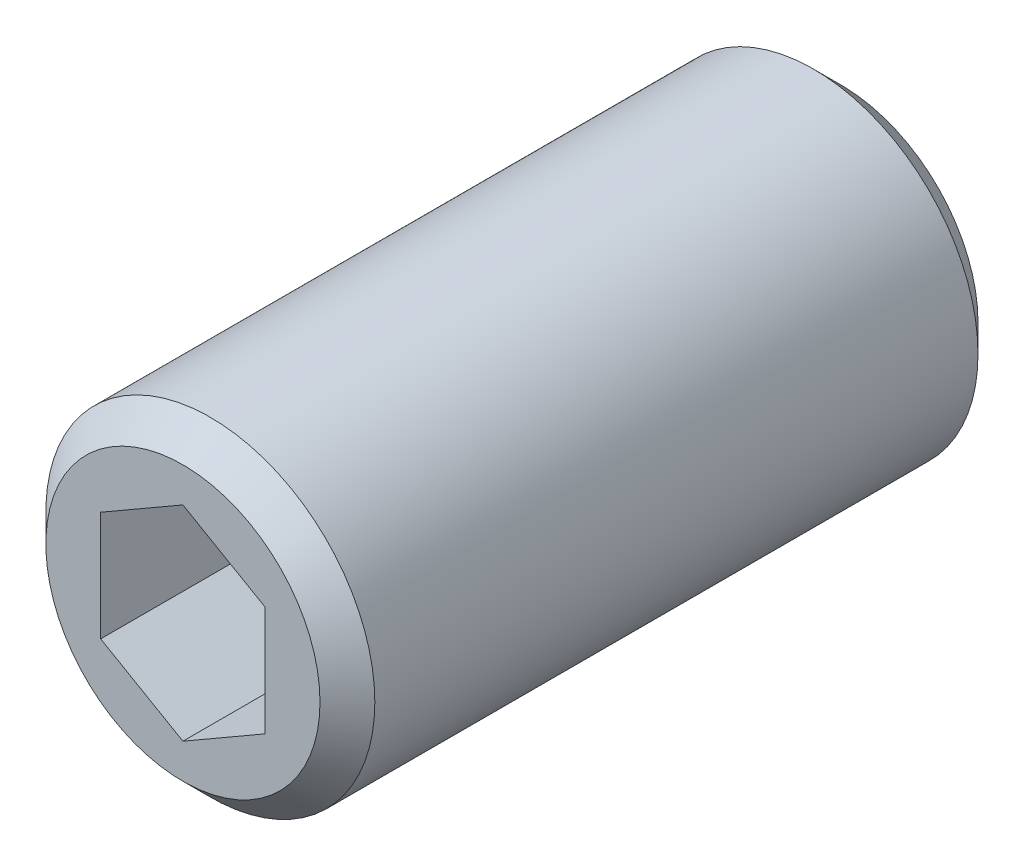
ISO-10303-21;
HEADER;
FILE_DESCRIPTION(('STEP AP214'),'2;1');
FILE_NAME('part.step','',(''),(''),'','','');
FILE_SCHEMA(('AUTOMOTIVE_DESIGN { 1 0 10303 214 1 1 1 1 }'));
ENDSEC;
DATA;
#1=APPLICATION_CONTEXT('core data for automotive mechanical design processes');
#2=APPLICATION_PROTOCOL_DEFINITION('international standard','automotive_design',2000,#1);
#3=PRODUCT_CONTEXT('',#1,'mechanical');
#4=PRODUCT('Part','Part','',(#3));
#5=PRODUCT_RELATED_PRODUCT_CATEGORY('part','',(#4));
#6=PRODUCT_DEFINITION_FORMATION('','',#4);
#7=PRODUCT_DEFINITION_CONTEXT('part definition',#1,'design');
#8=PRODUCT_DEFINITION('design','',#6,#7);
#9=PRODUCT_DEFINITION_SHAPE('','',#8);
#10=(LENGTH_UNIT() NAMED_UNIT(*) SI_UNIT(.MILLI.,.METRE.));
#11=(NAMED_UNIT(*) PLANE_ANGLE_UNIT() SI_UNIT($,.RADIAN.));
#12=(NAMED_UNIT(*) SI_UNIT($,.STERADIAN.) SOLID_ANGLE_UNIT());
#13=UNCERTAINTY_MEASURE_WITH_UNIT(LENGTH_MEASURE(1.E-05),#10,'distance_accuracy_value','');
#14=(GEOMETRIC_REPRESENTATION_CONTEXT(3) GLOBAL_UNCERTAINTY_ASSIGNED_CONTEXT((#13)) GLOBAL_UNIT_ASSIGNED_CONTEXT((#10,
#11,#12)) REPRESENTATION_CONTEXT('',''));
#15=CARTESIAN_POINT('',(0.,0.,0.));
#16=DIRECTION('',(0.,0.,1.));
#17=DIRECTION('',(1.,0.,0.));
#18=AXIS2_PLACEMENT_3D('',#15,#16,#17);
#19=CARTESIAN_POINT('',(0.,1.86602540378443,8.));
#20=DIRECTION('',(-0.499999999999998,0.86602540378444,0.));
#21=DIRECTION('',(-0.86602540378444,-0.499999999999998,0.));
#22=AXIS2_PLACEMENT_3D('',#19,#20,#21);
#23=PLANE('',#22);
#24=DIRECTION('',(0.,0.,1.));
#25=VECTOR('',#24,1.);
#26=CARTESIAN_POINT('',(0.,1.86602540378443,8.));
#27=LINE('',#26,#25);
#28=CARTESIAN_POINT('',(0.,1.86602540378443,8.));
#29=VERTEX_POINT('',#28);
#30=CARTESIAN_POINT('',(0.,1.86602540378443,12.));
#31=VERTEX_POINT('',#30);
#32=EDGE_CURVE('E49',#29,#31,#27,.T.);
#33=ORIENTED_EDGE('',*,*,#32,.T.);
#34=DIRECTION('',(-0.86602540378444,-0.499999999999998,0.));
#35=VECTOR('',#34,1.);
#36=CARTESIAN_POINT('',(0.,1.86602540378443,12.));
#37=LINE('',#36,#35);
#38=CARTESIAN_POINT('',(-1.5,1.,12.));
#39=VERTEX_POINT('',#38);
#40=EDGE_CURVE('E42',#31,#39,#37,.T.);
#41=ORIENTED_EDGE('',*,*,#40,.T.);
#42=DIRECTION('',(0.,0.,1.));
#43=VECTOR('',#42,1.);
#44=CARTESIAN_POINT('',(-1.5,1.,8.));
#45=LINE('',#44,#43);
#46=CARTESIAN_POINT('',(-1.5,1.,8.));
#47=VERTEX_POINT('',#46);
#48=EDGE_CURVE('E93',#47,#39,#45,.T.);
#49=ORIENTED_EDGE('',*,*,#48,.F.);
#50=DIRECTION('',(-0.86602540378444,-0.499999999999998,0.));
#51=VECTOR('',#50,1.);
#52=CARTESIAN_POINT('',(0.,1.86602540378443,8.));
#53=LINE('',#52,#51);
#54=EDGE_CURVE('E114',#29,#47,#53,.T.);
#55=ORIENTED_EDGE('',*,*,#54,.F.);
#56=EDGE_LOOP('',(#33,#41,#49,#55));
#57=FACE_BOUND('',#56,.T.);
#58=ADVANCED_FACE('F27',(#57),#23,.F.);
#59=CARTESIAN_POINT('',(1.5,1.,8.));
#60=DIRECTION('',(0.499999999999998,0.86602540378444,0.));
#61=DIRECTION('',(-0.86602540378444,0.499999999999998,0.));
#62=AXIS2_PLACEMENT_3D('',#59,#60,#61);
#63=PLANE('',#62);
#64=DIRECTION('',(0.,0.,1.));
#65=VECTOR('',#64,1.);
#66=CARTESIAN_POINT('',(1.5,1.,8.));
#67=LINE('',#66,#65);
#68=CARTESIAN_POINT('',(1.5,1.,8.));
#69=VERTEX_POINT('',#68);
#70=CARTESIAN_POINT('',(1.5,1.,12.));
#71=VERTEX_POINT('',#70);
#72=EDGE_CURVE('E133',#69,#71,#67,.T.);
#73=ORIENTED_EDGE('',*,*,#72,.T.);
#74=DIRECTION('',(-0.86602540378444,0.499999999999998,0.));
#75=VECTOR('',#74,1.);
#76=CARTESIAN_POINT('',(1.5,1.,12.));
#77=LINE('',#76,#75);
#78=EDGE_CURVE('E112',#71,#31,#77,.T.);
#79=ORIENTED_EDGE('',*,*,#78,.T.);
#80=ORIENTED_EDGE('',*,*,#32,.F.);
#81=DIRECTION('',(-0.86602540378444,0.499999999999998,0.));
#82=VECTOR('',#81,1.);
#83=CARTESIAN_POINT('',(1.5,1.,8.));
#84=LINE('',#83,#82);
#85=EDGE_CURVE('E126',#69,#29,#84,.T.);
#86=ORIENTED_EDGE('',*,*,#85,.F.);
#87=EDGE_LOOP('',(#73,#79,#80,#86));
#88=FACE_BOUND('',#87,.T.);
#89=ADVANCED_FACE('F170',(#88),#63,.F.);
#90=CARTESIAN_POINT('',(1.5,-1.,8.));
#91=DIRECTION('',(1.,0.,0.));
#92=DIRECTION('',(0.,0.,-1.));
#93=AXIS2_PLACEMENT_3D('',#90,#91,#92);
#94=PLANE('',#93);
#95=DIRECTION('',(0.,0.,1.));
#96=VECTOR('',#95,1.);
#97=CARTESIAN_POINT('',(1.5,-1.,8.));
#98=LINE('',#97,#96);
#99=CARTESIAN_POINT('',(1.5,-1.,8.));
#100=VERTEX_POINT('',#99);
#101=CARTESIAN_POINT('',(1.5,-1.,12.));
#102=VERTEX_POINT('',#101);
#103=EDGE_CURVE('E131',#100,#102,#98,.T.);
#104=ORIENTED_EDGE('',*,*,#103,.T.);
#105=DIRECTION('',(0.,1.,0.));
#106=VECTOR('',#105,1.);
#107=CARTESIAN_POINT('',(1.5,-1.,12.));
#108=LINE('',#107,#106);
#109=EDGE_CURVE('E106',#102,#71,#108,.T.);
#110=ORIENTED_EDGE('',*,*,#109,.T.);
#111=ORIENTED_EDGE('',*,*,#72,.F.);
#112=DIRECTION('',(0.,1.,0.));
#113=VECTOR('',#112,1.);
#114=CARTESIAN_POINT('',(1.5,-1.,8.));
#115=LINE('',#114,#113);
#116=EDGE_CURVE('E123',#100,#69,#115,.T.);
#117=ORIENTED_EDGE('',*,*,#116,.F.);
#118=EDGE_LOOP('',(#104,#110,#111,#117));
#119=FACE_BOUND('',#118,.T.);
#120=ADVANCED_FACE('F175',(#119),#94,.F.);
#121=CARTESIAN_POINT('',(0.,-1.86602540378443,8.));
#122=DIRECTION('',(0.499999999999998,-0.86602540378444,0.));
#123=DIRECTION('',(0.86602540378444,0.499999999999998,0.));
#124=AXIS2_PLACEMENT_3D('',#121,#122,#123);
#125=PLANE('',#124);
#126=DIRECTION('',(0.,0.,1.));
#127=VECTOR('',#126,1.);
#128=CARTESIAN_POINT('',(0.,-1.86602540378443,8.));
#129=LINE('',#128,#127);
#130=CARTESIAN_POINT('',(0.,-1.86602540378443,8.));
#131=VERTEX_POINT('',#130);
#132=CARTESIAN_POINT('',(0.,-1.86602540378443,12.));
#133=VERTEX_POINT('',#132);
#134=EDGE_CURVE('E92',#131,#133,#129,.T.);
#135=ORIENTED_EDGE('',*,*,#134,.T.);
#136=DIRECTION('',(0.86602540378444,0.499999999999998,0.));
#137=VECTOR('',#136,1.);
#138=CARTESIAN_POINT('',(0.,-1.86602540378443,12.));
#139=LINE('',#138,#137);
#140=EDGE_CURVE('E104',#133,#102,#139,.T.);
#141=ORIENTED_EDGE('',*,*,#140,.T.);
#142=ORIENTED_EDGE('',*,*,#103,.F.);
#143=DIRECTION('',(0.86602540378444,0.499999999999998,0.));
#144=VECTOR('',#143,1.);
#145=CARTESIAN_POINT('',(0.,-1.86602540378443,8.));
#146=LINE('',#145,#144);
#147=EDGE_CURVE('E120',#131,#100,#146,.T.);
#148=ORIENTED_EDGE('',*,*,#147,.F.);
#149=EDGE_LOOP('',(#135,#141,#142,#148));
#150=FACE_BOUND('',#149,.T.);
#151=ADVANCED_FACE('F181',(#150),#125,.F.);
#152=CARTESIAN_POINT('',(-1.5,-1.,8.));
#153=DIRECTION('',(-0.499999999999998,-0.86602540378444,0.));
#154=DIRECTION('',(0.86602540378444,-0.499999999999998,0.));
#155=AXIS2_PLACEMENT_3D('',#152,#153,#154);
#156=PLANE('',#155);
#157=DIRECTION('',(0.,0.,1.));
#158=VECTOR('',#157,1.);
#159=CARTESIAN_POINT('',(-1.5,-1.,8.));
#160=LINE('',#159,#158);
#161=CARTESIAN_POINT('',(-1.5,-1.,8.));
#162=VERTEX_POINT('',#161);
#163=CARTESIAN_POINT('',(-1.5,-1.,12.));
#164=VERTEX_POINT('',#163);
#165=EDGE_CURVE('E81',#162,#164,#160,.T.);
#166=ORIENTED_EDGE('',*,*,#165,.T.);
#167=DIRECTION('',(0.86602540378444,-0.499999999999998,0.));
#168=VECTOR('',#167,1.);
#169=CARTESIAN_POINT('',(-1.5,-1.,12.));
#170=LINE('',#169,#168);
#171=EDGE_CURVE('E85',#164,#133,#170,.T.);
#172=ORIENTED_EDGE('',*,*,#171,.T.);
#173=ORIENTED_EDGE('',*,*,#134,.F.);
#174=DIRECTION('',(0.86602540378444,-0.499999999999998,0.));
#175=VECTOR('',#174,1.);
#176=CARTESIAN_POINT('',(-1.5,-1.,8.));
#177=LINE('',#176,#175);
#178=EDGE_CURVE('E88',#162,#131,#177,.T.);
#179=ORIENTED_EDGE('',*,*,#178,.F.);
#180=EDGE_LOOP('',(#166,#172,#173,#179));
#181=FACE_BOUND('',#180,.T.);
#182=ADVANCED_FACE('F83',(#181),#156,.F.);
#183=CARTESIAN_POINT('',(-1.5,1.,8.));
#184=DIRECTION('',(-1.,0.,0.));
#185=DIRECTION('',(0.,-1.,0.));
#186=AXIS2_PLACEMENT_3D('',#183,#184,#185);
#187=PLANE('',#186);
#188=DIRECTION('',(0.,-1.,0.));
#189=VECTOR('',#188,1.);
#190=CARTESIAN_POINT('',(-1.5,1.,8.));
#191=LINE('',#190,#189);
#192=EDGE_CURVE('E117',#47,#162,#191,.T.);
#193=ORIENTED_EDGE('',*,*,#192,.F.);
#194=ORIENTED_EDGE('',*,*,#48,.T.);
#195=DIRECTION('',(0.,-1.,0.));
#196=VECTOR('',#195,1.);
#197=CARTESIAN_POINT('',(-1.5,1.,12.));
#198=LINE('',#197,#196);
#199=EDGE_CURVE('E96',#39,#164,#198,.T.);
#200=ORIENTED_EDGE('',*,*,#199,.T.);
#201=ORIENTED_EDGE('',*,*,#165,.F.);
#202=EDGE_LOOP('',(#193,#194,#200,#201));
#203=FACE_BOUND('',#202,.T.);
#204=ADVANCED_FACE('F97',(#203),#187,.F.);
#205=CARTESIAN_POINT('',(1.5,2.73205080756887,8.));
#206=DIRECTION('',(0.,0.,-1.));
#207=DIRECTION('',(-1.,0.,0.));
#208=AXIS2_PLACEMENT_3D('',#205,#206,#207);
#209=PLANE('',#208);
#210=ORIENTED_EDGE('',*,*,#54,.T.);
#211=ORIENTED_EDGE('',*,*,#192,.T.);
#212=ORIENTED_EDGE('',*,*,#178,.T.);
#213=ORIENTED_EDGE('',*,*,#147,.T.);
#214=ORIENTED_EDGE('',*,*,#116,.T.);
#215=ORIENTED_EDGE('',*,*,#85,.T.);
#216=EDGE_LOOP('',(#210,#211,#212,#213,#214,#215));
#217=FACE_BOUND('',#216,.T.);
#218=ADVANCED_FACE('F155',(#217),#209,.F.);
#219=CARTESIAN_POINT('',(0.,0.,12.));
#220=DIRECTION('',(0.,0.,-1.));
#221=DIRECTION('',(-1.,0.,0.));
#222=AXIS2_PLACEMENT_3D('',#219,#220,#221);
#223=CYLINDRICAL_SURFACE('',#222,3.);
#224=CARTESIAN_POINT('',(0.,0.,0.500000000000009));
#225=DIRECTION('',(0.,0.,1.));
#226=DIRECTION('',(1.,0.,0.));
#227=AXIS2_PLACEMENT_3D('',#224,#225,#226);
#228=CIRCLE('',#227,3.);
#229=CARTESIAN_POINT('',(3.,0.,0.500000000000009));
#230=VERTEX_POINT('',#229);
#231=EDGE_CURVE('E139',#230,#230,#228,.T.);
#232=ORIENTED_EDGE('',*,*,#231,.T.);
#233=EDGE_LOOP('',(#232));
#234=FACE_BOUND('',#233,.T.);
#235=CARTESIAN_POINT('',(0.,0.,11.5));
#236=DIRECTION('',(0.,0.,1.));
#237=DIRECTION('',(1.,0.,0.));
#238=AXIS2_PLACEMENT_3D('',#235,#236,#237);
#239=CIRCLE('',#238,3.);
#240=CARTESIAN_POINT('',(3.,0.,11.5));
#241=VERTEX_POINT('',#240);
#242=EDGE_CURVE('E136',#241,#241,#239,.F.);
#243=ORIENTED_EDGE('',*,*,#242,.T.);
#244=EDGE_LOOP('',(#243));
#245=FACE_BOUND('',#244,.T.);
#246=ADVANCED_FACE('F29',(#234,#245),#223,.T.);
#247=CARTESIAN_POINT('',(0.,0.,12.));
#248=DIRECTION('',(0.,0.,1.));
#249=DIRECTION('',(1.,0.,0.));
#250=AXIS2_PLACEMENT_3D('',#247,#248,#249);
#251=PLANE('',#250);
#252=ORIENTED_EDGE('',*,*,#40,.F.);
#253=ORIENTED_EDGE('',*,*,#78,.F.);
#254=ORIENTED_EDGE('',*,*,#109,.F.);
#255=ORIENTED_EDGE('',*,*,#140,.F.);
#256=ORIENTED_EDGE('',*,*,#171,.F.);
#257=ORIENTED_EDGE('',*,*,#199,.F.);
#258=EDGE_LOOP('',(#252,#253,#254,#255,#256,#257));
#259=FACE_BOUND('',#258,.T.);
#260=CARTESIAN_POINT('',(0.,0.,12.));
#261=DIRECTION('',(0.,0.,1.));
#262=DIRECTION('',(1.,0.,0.));
#263=AXIS2_PLACEMENT_3D('',#260,#261,#262);
#264=CIRCLE('',#263,2.49999999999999);
#265=CARTESIAN_POINT('',(2.49999999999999,0.,12.));
#266=VERTEX_POINT('',#265);
#267=EDGE_CURVE('E11',#266,#266,#264,.T.);
#268=ORIENTED_EDGE('',*,*,#267,.T.);
#269=EDGE_LOOP('',(#268));
#270=FACE_BOUND('',#269,.T.);
#271=ADVANCED_FACE('F100',(#259,#270),#251,.T.);
#272=CARTESIAN_POINT('',(0.,0.,0.));
#273=DIRECTION('',(0.,0.,1.));
#274=DIRECTION('',(1.,0.,0.));
#275=AXIS2_PLACEMENT_3D('',#272,#273,#274);
#276=PLANE('',#275);
#277=CARTESIAN_POINT('',(0.,0.,0.));
#278=DIRECTION('',(0.,0.,1.));
#279=DIRECTION('',(1.,0.,0.));
#280=AXIS2_PLACEMENT_3D('',#277,#278,#279);
#281=CIRCLE('',#280,2.5);
#282=CARTESIAN_POINT('',(2.5,0.,0.));
#283=VERTEX_POINT('',#282);
#284=EDGE_CURVE('E35',#283,#283,#281,.F.);
#285=ORIENTED_EDGE('',*,*,#284,.T.);
#286=EDGE_LOOP('',(#285));
#287=FACE_BOUND('',#286,.T.);
#288=ADVANCED_FACE('F144',(#287),#276,.F.);
#289=CARTESIAN_POINT('',(0.,0.,0.500000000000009));
#290=DIRECTION('',(0.,0.,1.));
#291=DIRECTION('',(1.,0.,0.));
#292=AXIS2_PLACEMENT_3D('',#289,#290,#291);
#293=CONICAL_SURFACE('',#292,3.,0.785398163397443);
#294=ORIENTED_EDGE('',*,*,#284,.F.);
#295=EDGE_LOOP('',(#294));
#296=FACE_BOUND('',#295,.T.);
#297=ORIENTED_EDGE('',*,*,#231,.F.);
#298=EDGE_LOOP('',(#297));
#299=FACE_BOUND('',#298,.T.);
#300=ADVANCED_FACE('F146',(#296,#299),#293,.T.);
#301=CARTESIAN_POINT('',(0.,0.,12.));
#302=DIRECTION('',(0.,0.,-1.));
#303=DIRECTION('',(-1.,0.,0.));
#304=AXIS2_PLACEMENT_3D('',#301,#302,#303);
#305=CONICAL_SURFACE('',#304,2.49999999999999,0.785398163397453);
#306=ORIENTED_EDGE('',*,*,#242,.F.);
#307=EDGE_LOOP('',(#306));
#308=FACE_BOUND('',#307,.T.);
#309=ORIENTED_EDGE('',*,*,#267,.F.);
#310=EDGE_LOOP('',(#309));
#311=FACE_BOUND('',#310,.T.);
#312=ADVANCED_FACE('F149',(#308,#311),#305,.T.);
#313=CLOSED_SHELL('',(#58,#89,#120,#151,#182,#204,#218,#246,#271,#288,#300,#312));
#314=MANIFOLD_SOLID_BREP('B2',#313);
#315=ADVANCED_BREP_SHAPE_REPRESENTATION('',(#18,#314),#14);
#316=SHAPE_DEFINITION_REPRESENTATION(#9,#315);
ENDSEC;
END-ISO-10303-21;
